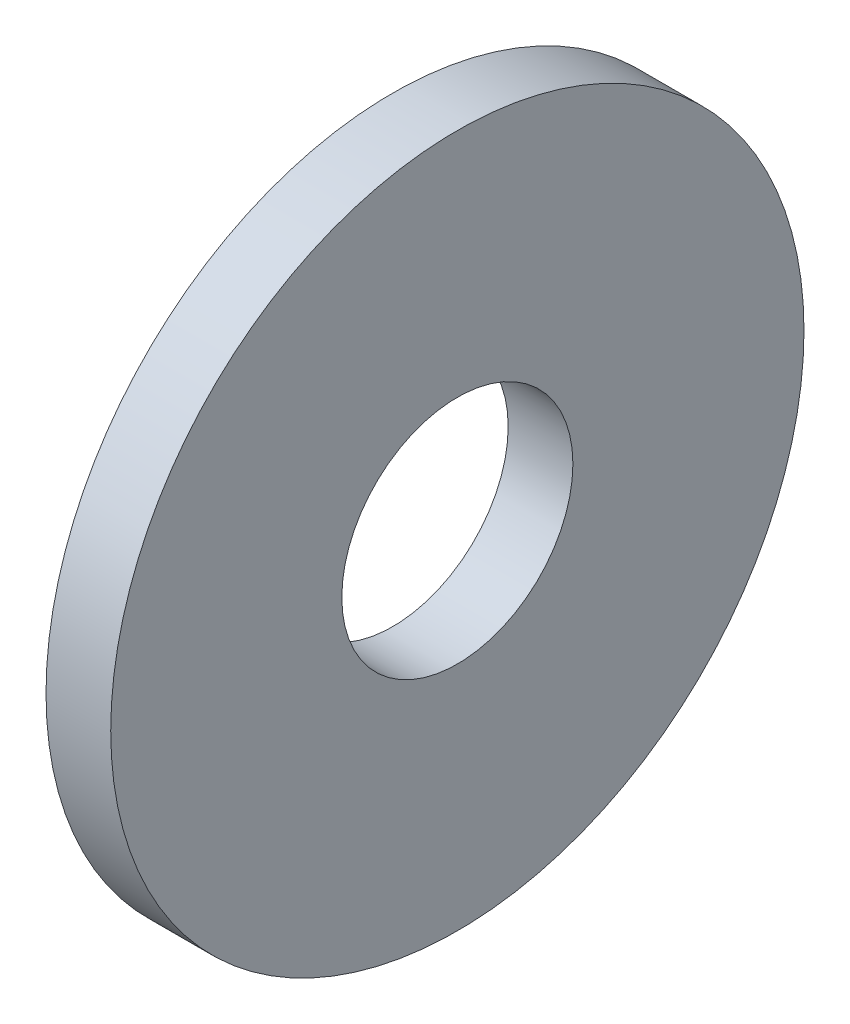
from build123d import *

# Parameters (mm, degrees)
SKETCH1_R           = 19.05
SKETCH1_R_2         = 6.35
BOSS_EXTRUDE1_DEPTH = 3.556


with BuildPart() as part:
    # Sketch1 → Boss-Extrude1 (new body)
    with BuildSketch(Plane(origin=(0, 0, 0), x_dir=(0, 0, -1), z_dir=(1, 0, 0))):
        Circle(SKETCH1_R)
        Circle(SKETCH1_R_2, mode=Mode.SUBTRACT)
    extrude(amount=BOSS_EXTRUDE1_DEPTH)


solid = part.part
